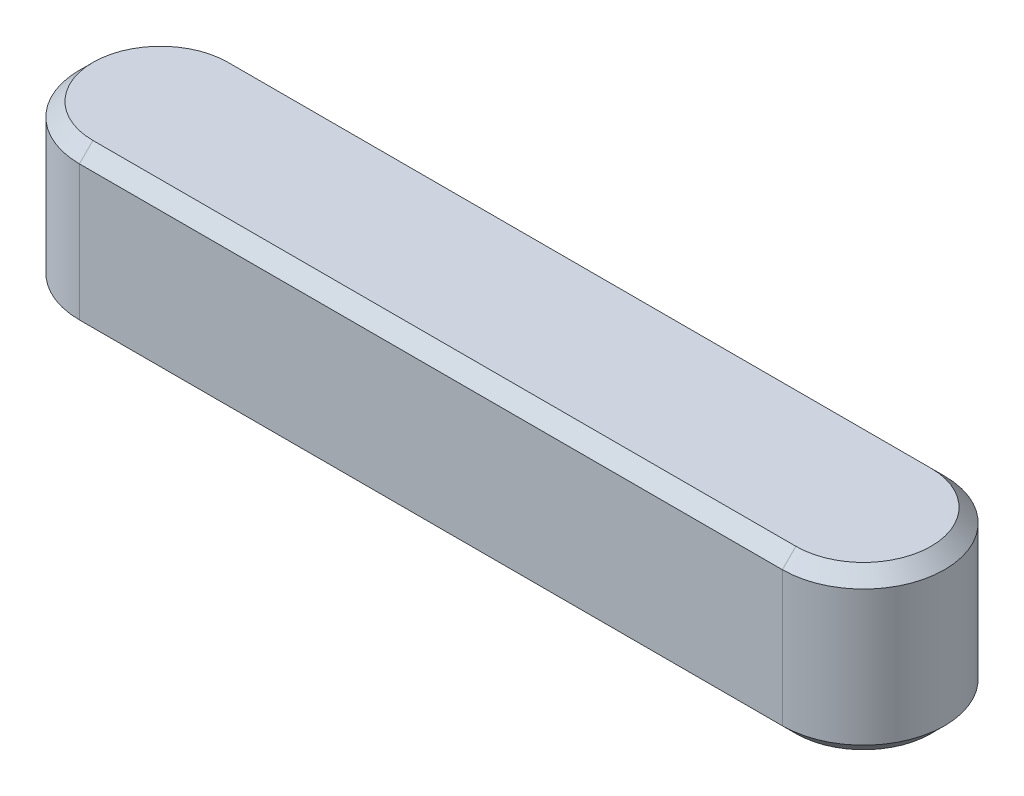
from build123d import *

# Parameters (mm, degrees)
BASE_EXTRUSION_DEPTH = 6
CHANFREIN1_0_5_SIZE  = 0.5


with BuildPart() as part:
    # Esquisse1 → Base-Extrusion (new body)
    with BuildSketch(Plane(origin=(0, 0, 0), x_dir=(1, 0, 0), z_dir=(0, 1, 0))):
        with BuildLine():
            Line((-13, 3), (13, 3))
            ThreePointArc((13, 3), (16, 0), (13, -3))
            Line((13, -3), (-13, -3))
            ThreePointArc((-13, -3), (-16, 0), (-13, 3))
        make_face()
    extrude(amount=BASE_EXTRUSION_DEPTH)

    # Chanfrein1-0.5
    chanfrein1_0_5_edges = [part.edges().sort_by_distance(p)[0] for p in [
        (0, 0, 3),
        (0, 6, 3),
        (-16, 0, 0),
        (-16, 6, 0),
        (0, 0, -3),
        (0, 6, -3),
        (16, 0, 0),
        (16, 6, 0),
    ]]
    chamfer(chanfrein1_0_5_edges, length=CHANFREIN1_0_5_SIZE)


solid = part.part
